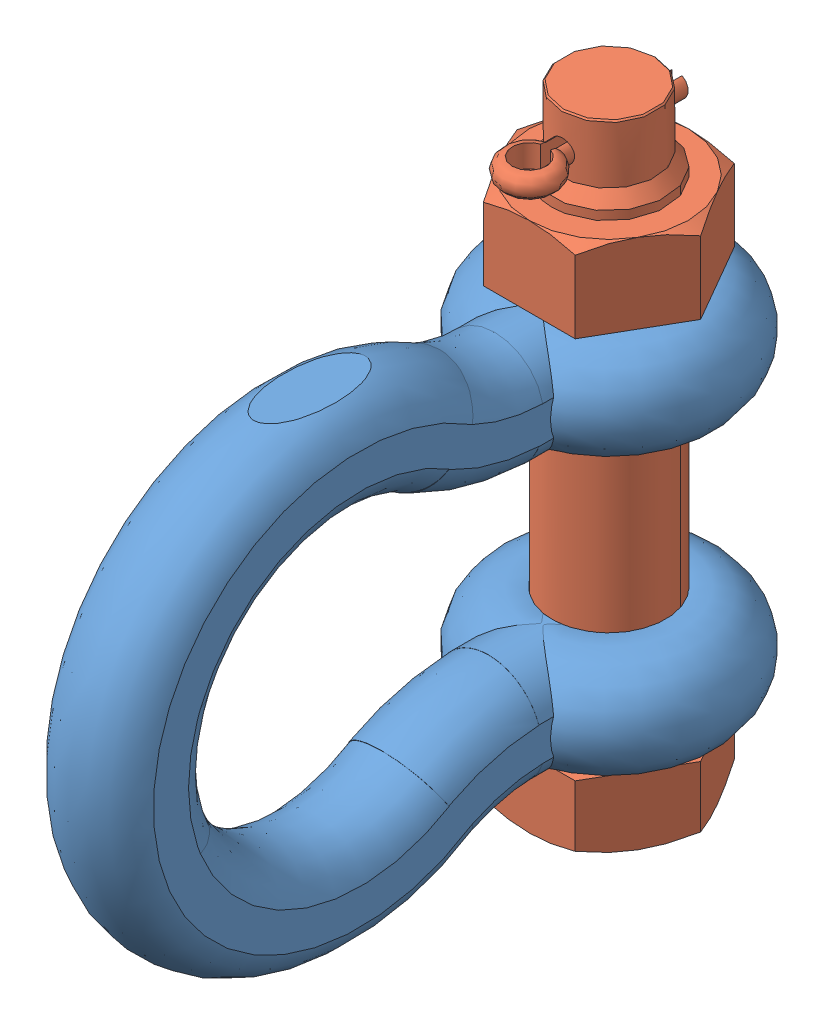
SolidWorks assembly bolt_type_anchor_shackles_1019551.SLDASM, configuration Default (file format 11000). Lengths in mm.
Overall size (60.5 154.07 167).
2 component instances, 2 part files, 0 mates.
Components (placement in the parent):
- bolt_type_anchor_shackles_1019551_01-1: bolt_type_anchor_shackles_1019551_01.SLDPRT [Default] at origin size (60.5 119 167)
- bolt_type_anchor_shackles_1019551_02-1: bolt_type_anchor_shackles_1019551_02.SLDPRT [Default] at origin size (46.4 154.07 47.36)
